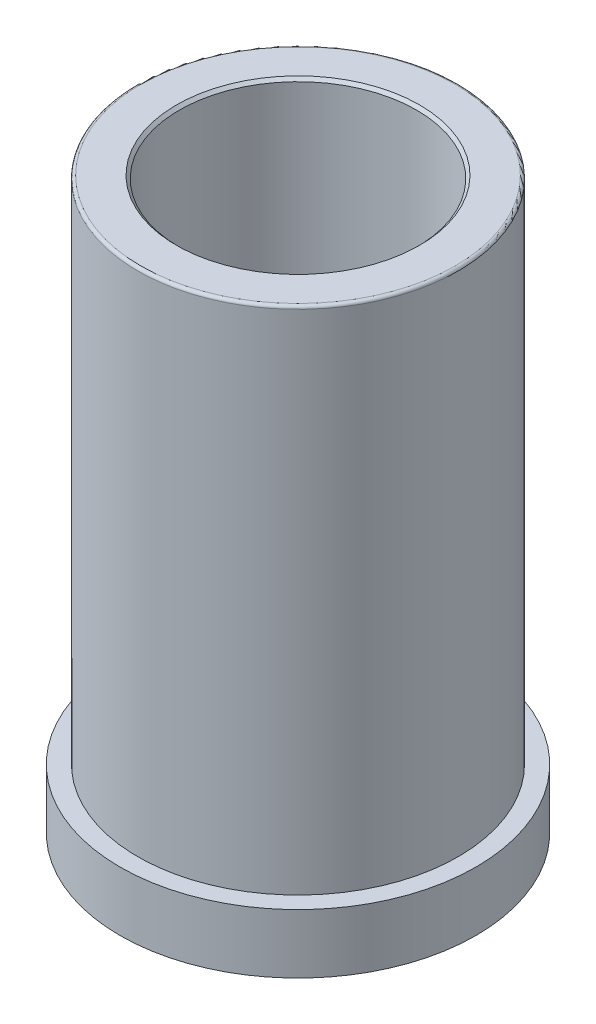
ISO-10303-21;
HEADER;
FILE_DESCRIPTION(('STEP AP214'),'2;1');
FILE_NAME('part.step','',(''),(''),'','','');
FILE_SCHEMA(('AUTOMOTIVE_DESIGN { 1 0 10303 214 1 1 1 1 }'));
ENDSEC;
DATA;
#1=APPLICATION_CONTEXT('core data for automotive mechanical design processes');
#2=APPLICATION_PROTOCOL_DEFINITION('international standard','automotive_design',2000,#1);
#3=PRODUCT_CONTEXT('',#1,'mechanical');
#4=PRODUCT('Part','Part','',(#3));
#5=PRODUCT_RELATED_PRODUCT_CATEGORY('part','',(#4));
#6=PRODUCT_DEFINITION_FORMATION('','',#4);
#7=PRODUCT_DEFINITION_CONTEXT('part definition',#1,'design');
#8=PRODUCT_DEFINITION('design','',#6,#7);
#9=PRODUCT_DEFINITION_SHAPE('','',#8);
#10=(LENGTH_UNIT() NAMED_UNIT(*) SI_UNIT(.MILLI.,.METRE.));
#11=(NAMED_UNIT(*) PLANE_ANGLE_UNIT() SI_UNIT($,.RADIAN.));
#12=(NAMED_UNIT(*) SI_UNIT($,.STERADIAN.) SOLID_ANGLE_UNIT());
#13=UNCERTAINTY_MEASURE_WITH_UNIT(LENGTH_MEASURE(1.E-05),#10,'distance_accuracy_value','');
#14=(GEOMETRIC_REPRESENTATION_CONTEXT(3) GLOBAL_UNCERTAINTY_ASSIGNED_CONTEXT((#13)) GLOBAL_UNIT_ASSIGNED_CONTEXT((#10,
#11,#12)) REPRESENTATION_CONTEXT('',''));
#15=CARTESIAN_POINT('',(0.,0.,0.));
#16=DIRECTION('',(0.,0.,1.));
#17=DIRECTION('',(1.,0.,0.));
#18=AXIS2_PLACEMENT_3D('',#15,#16,#17);
#19=CARTESIAN_POINT('',(0.,0.,0.));
#20=DIRECTION('',(0.,-1.,0.));
#21=DIRECTION('',(0.,0.,-1.));
#22=AXIS2_PLACEMENT_3D('',#19,#20,#21);
#23=CYLINDRICAL_SURFACE('',#22,27.);
#24=CARTESIAN_POINT('',(0.,85.5,0.));
#25=DIRECTION('',(0.,-1.,0.));
#26=DIRECTION('',(0.,0.,-1.));
#27=AXIS2_PLACEMENT_3D('',#24,#25,#26);
#28=CIRCLE('',#27,27.);
#29=CARTESIAN_POINT('',(0.,85.5,-27.));
#30=VERTEX_POINT('',#29);
#31=EDGE_CURVE('E21',#30,#30,#28,.T.);
#32=ORIENTED_EDGE('',*,*,#31,.T.);
#33=EDGE_LOOP('',(#32));
#34=FACE_BOUND('',#33,.T.);
#35=CARTESIAN_POINT('',(0.,0.,0.));
#36=DIRECTION('',(0.,-1.,0.));
#37=DIRECTION('',(0.,0.,-1.));
#38=AXIS2_PLACEMENT_3D('',#35,#36,#37);
#39=CIRCLE('',#38,27.);
#40=CARTESIAN_POINT('',(0.,0.,-27.));
#41=VERTEX_POINT('',#40);
#42=EDGE_CURVE('E49',#41,#41,#39,.T.);
#43=ORIENTED_EDGE('',*,*,#42,.F.);
#44=EDGE_LOOP('',(#43));
#45=FACE_BOUND('',#44,.T.);
#46=ADVANCED_FACE('F14',(#34,#45),#23,.T.);
#47=CARTESIAN_POINT('',(-27.,86.,0.));
#48=DIRECTION('',(0.,-1.,0.));
#49=DIRECTION('',(0.,0.,-1.));
#50=AXIS2_PLACEMENT_3D('',#47,#48,#49);
#51=PLANE('',#50);
#52=CARTESIAN_POINT('',(0.,86.,0.));
#53=DIRECTION('',(0.,-1.,0.));
#54=DIRECTION('',(0.,0.,-1.));
#55=AXIS2_PLACEMENT_3D('',#52,#53,#54);
#56=CIRCLE('',#55,26.5);
#57=CARTESIAN_POINT('',(0.,86.,-26.5));
#58=VERTEX_POINT('',#57);
#59=EDGE_CURVE('E9',#58,#58,#56,.F.);
#60=ORIENTED_EDGE('',*,*,#59,.T.);
#61=EDGE_LOOP('',(#60));
#62=FACE_BOUND('',#61,.T.);
#63=CARTESIAN_POINT('',(0.,86.,0.));
#64=DIRECTION('',(0.,-1.,0.));
#65=DIRECTION('',(0.,0.,-1.));
#66=AXIS2_PLACEMENT_3D('',#63,#64,#65);
#67=CIRCLE('',#66,20.5);
#68=CARTESIAN_POINT('',(0.,86.,-20.5));
#69=VERTEX_POINT('',#68);
#70=EDGE_CURVE('E37',#69,#69,#67,.T.);
#71=ORIENTED_EDGE('',*,*,#70,.T.);
#72=EDGE_LOOP('',(#71));
#73=FACE_BOUND('',#72,.T.);
#74=ADVANCED_FACE('F56',(#62,#73),#51,.F.);
#75=CARTESIAN_POINT('',(0.,0.,0.));
#76=DIRECTION('',(0.,-1.,0.));
#77=DIRECTION('',(0.,0.,-1.));
#78=AXIS2_PLACEMENT_3D('',#75,#76,#77);
#79=CYLINDRICAL_SURFACE('',#78,20.);
#80=CARTESIAN_POINT('',(0.,85.5,0.));
#81=DIRECTION('',(0.,-1.,0.));
#82=DIRECTION('',(0.,0.,-1.));
#83=AXIS2_PLACEMENT_3D('',#80,#81,#82);
#84=CIRCLE('',#83,20.);
#85=CARTESIAN_POINT('',(0.,85.5,-20.));
#86=VERTEX_POINT('',#85);
#87=EDGE_CURVE('E34',#86,#86,#84,.F.);
#88=ORIENTED_EDGE('',*,*,#87,.T.);
#89=EDGE_LOOP('',(#88));
#90=FACE_BOUND('',#89,.T.);
#91=CARTESIAN_POINT('',(0.,-10.,0.));
#92=DIRECTION('',(0.,-1.,0.));
#93=DIRECTION('',(0.,0.,-1.));
#94=AXIS2_PLACEMENT_3D('',#91,#92,#93);
#95=CIRCLE('',#94,20.);
#96=CARTESIAN_POINT('',(0.,-10.,-20.));
#97=VERTEX_POINT('',#96);
#98=EDGE_CURVE('E40',#97,#97,#95,.T.);
#99=ORIENTED_EDGE('',*,*,#98,.T.);
#100=EDGE_LOOP('',(#99));
#101=FACE_BOUND('',#100,.T.);
#102=ADVANCED_FACE('F63',(#90,#101),#79,.F.);
#103=CARTESIAN_POINT('',(0.,-10.15,0.));
#104=DIRECTION('',(0.,-1.,0.));
#105=DIRECTION('',(0.,0.,-1.));
#106=AXIS2_PLACEMENT_3D('',#103,#104,#105);
#107=CONICAL_SURFACE('',#106,20.1,0.588002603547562);
#108=CARTESIAN_POINT('',(0.,-10.36,0.));
#109=DIRECTION('',(0.,1.,0.));
#110=DIRECTION('',(0.,0.,1.));
#111=AXIS2_PLACEMENT_3D('',#108,#109,#110);
#112=CIRCLE('',#111,20.24);
#113=CARTESIAN_POINT('',(0.,-10.36,20.24));
#114=VERTEX_POINT('',#113);
#115=EDGE_CURVE('E25',#114,#114,#112,.F.);
#116=ORIENTED_EDGE('',*,*,#115,.T.);
#117=EDGE_LOOP('',(#116));
#118=FACE_BOUND('',#117,.T.);
#119=ORIENTED_EDGE('',*,*,#98,.F.);
#120=EDGE_LOOP('',(#119));
#121=FACE_BOUND('',#120,.T.);
#122=ADVANCED_FACE('F82',(#118,#121),#107,.F.);
#123=CARTESIAN_POINT('',(-20.1,-10.,0.));
#124=DIRECTION('',(0.,1.,0.));
#125=DIRECTION('',(0.,0.,1.));
#126=AXIS2_PLACEMENT_3D('',#123,#124,#125);
#127=PLANE('',#126);
#128=CARTESIAN_POINT('',(0.,-10.,0.));
#129=DIRECTION('',(0.,1.,0.));
#130=DIRECTION('',(0.,0.,1.));
#131=AXIS2_PLACEMENT_3D('',#128,#129,#130);
#132=CIRCLE('',#131,20.6);
#133=CARTESIAN_POINT('',(0.,-10.,20.6));
#134=VERTEX_POINT('',#133);
#135=EDGE_CURVE('E29',#134,#134,#132,.T.);
#136=ORIENTED_EDGE('',*,*,#135,.T.);
#137=EDGE_LOOP('',(#136));
#138=FACE_BOUND('',#137,.T.);
#139=CARTESIAN_POINT('',(0.,-10.,0.));
#140=DIRECTION('',(0.,-1.,0.));
#141=DIRECTION('',(0.,0.,-1.));
#142=AXIS2_PLACEMENT_3D('',#139,#140,#141);
#143=CIRCLE('',#142,30.);
#144=CARTESIAN_POINT('',(0.,-10.,-30.));
#145=VERTEX_POINT('',#144);
#146=EDGE_CURVE('E43',#145,#145,#143,.T.);
#147=ORIENTED_EDGE('',*,*,#146,.T.);
#148=EDGE_LOOP('',(#147));
#149=FACE_BOUND('',#148,.T.);
#150=ADVANCED_FACE('F85',(#138,#149),#127,.F.);
#151=CARTESIAN_POINT('',(0.,0.,0.));
#152=DIRECTION('',(0.,-1.,0.));
#153=DIRECTION('',(0.,0.,-1.));
#154=AXIS2_PLACEMENT_3D('',#151,#152,#153);
#155=CYLINDRICAL_SURFACE('',#154,30.);
#156=ORIENTED_EDGE('',*,*,#146,.F.);
#157=EDGE_LOOP('',(#156));
#158=FACE_BOUND('',#157,.T.);
#159=CARTESIAN_POINT('',(0.,0.,0.));
#160=DIRECTION('',(0.,-1.,0.));
#161=DIRECTION('',(0.,0.,-1.));
#162=AXIS2_PLACEMENT_3D('',#159,#160,#161);
#163=CIRCLE('',#162,30.);
#164=CARTESIAN_POINT('',(0.,0.,-30.));
#165=VERTEX_POINT('',#164);
#166=EDGE_CURVE('E46',#165,#165,#163,.T.);
#167=ORIENTED_EDGE('',*,*,#166,.T.);
#168=EDGE_LOOP('',(#167));
#169=FACE_BOUND('',#168,.T.);
#170=ADVANCED_FACE('F97',(#158,#169),#155,.T.);
#171=CARTESIAN_POINT('',(-30.,0.,0.));
#172=DIRECTION('',(0.,-1.,0.));
#173=DIRECTION('',(0.,0.,-1.));
#174=AXIS2_PLACEMENT_3D('',#171,#172,#173);
#175=PLANE('',#174);
#176=ORIENTED_EDGE('',*,*,#166,.F.);
#177=EDGE_LOOP('',(#176));
#178=FACE_BOUND('',#177,.T.);
#179=ORIENTED_EDGE('',*,*,#42,.T.);
#180=EDGE_LOOP('',(#179));
#181=FACE_BOUND('',#180,.T.);
#182=ADVANCED_FACE('F53',(#178,#181),#175,.F.);
#183=CARTESIAN_POINT('',(0.,86.,0.));
#184=DIRECTION('',(0.,1.,0.));
#185=DIRECTION('',(0.,0.,1.));
#186=AXIS2_PLACEMENT_3D('',#183,#184,#185);
#187=CONICAL_SURFACE('',#186,20.5,0.785398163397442);
#188=ORIENTED_EDGE('',*,*,#87,.F.);
#189=EDGE_LOOP('',(#188));
#190=FACE_BOUND('',#189,.T.);
#191=ORIENTED_EDGE('',*,*,#70,.F.);
#192=EDGE_LOOP('',(#191));
#193=FACE_BOUND('',#192,.T.);
#194=ADVANCED_FACE('F67',(#190,#193),#187,.F.);
#195=CARTESIAN_POINT('',(0.,-10.5,0.));
#196=DIRECTION('',(0.,1.,0.));
#197=DIRECTION('',(0.,0.,1.));
#198=AXIS2_PLACEMENT_3D('',#195,#196,#197);
#199=CONICAL_SURFACE('',#198,20.1,0.785398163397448);
#200=ORIENTED_EDGE('',*,*,#135,.F.);
#201=EDGE_LOOP('',(#200));
#202=FACE_BOUND('',#201,.T.);
#203=ORIENTED_EDGE('',*,*,#115,.F.);
#204=EDGE_LOOP('',(#203));
#205=FACE_BOUND('',#204,.T.);
#206=ADVANCED_FACE('F69',(#202,#205),#199,.T.);
#207=CARTESIAN_POINT('',(0.,85.5,0.));
#208=DIRECTION('',(0.,-1.,0.));
#209=DIRECTION('',(0.,0.,-1.));
#210=AXIS2_PLACEMENT_3D('',#207,#208,#209);
#211=TOROIDAL_SURFACE('',#210,26.5,0.5);
#212=ORIENTED_EDGE('',*,*,#59,.F.);
#213=EDGE_LOOP('',(#212));
#214=FACE_BOUND('',#213,.T.);
#215=ORIENTED_EDGE('',*,*,#31,.F.);
#216=EDGE_LOOP('',(#215));
#217=FACE_BOUND('',#216,.T.);
#218=ADVANCED_FACE('F16',(#214,#217),#211,.T.);
#219=CLOSED_SHELL('',(#46,#74,#102,#122,#150,#170,#182,#194,#206,#218));
#220=MANIFOLD_SOLID_BREP('B1',#219);
#221=ADVANCED_BREP_SHAPE_REPRESENTATION('',(#18,#220),#14);
#222=SHAPE_DEFINITION_REPRESENTATION(#9,#221);
ENDSEC;
END-ISO-10303-21;
